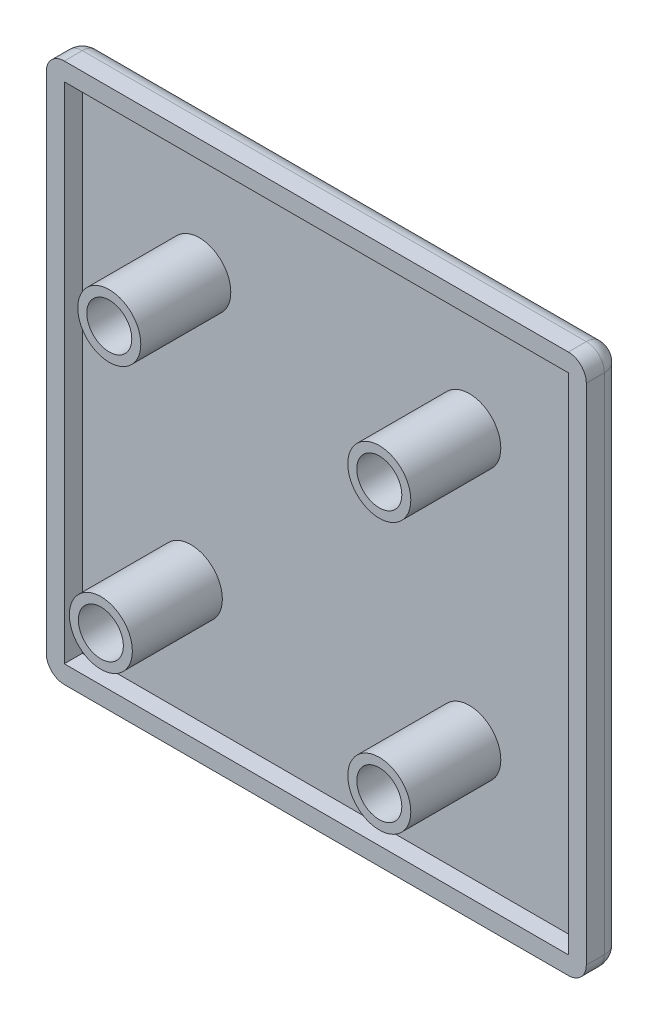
from build123d import *

# Parameters (mm, degrees)
SKETCH_1_W      = 60
SKETCH_1_H      = 60
EXTRUDE_1_DEPTH = 2
SHELL_1_T       = -2
FILLET_2_R      = 2
SKETCH_2_R      = 3.5
SKETCH_2_R_2    = 2.5
EXTRUDE_2_DEPTH = 10


with BuildPart() as part:
    # Sketch 1 → Extrude 1 (new, symmetric)
    with BuildSketch(Plane.XY):
        Rectangle(SKETCH_1_W, SKETCH_1_H)
    extrude(amount=EXTRUDE_1_DEPTH, both=True)

    # Shell 1
    shell_1_openings = [part.faces().sort_by_distance(p)[0] for p in [
        (0, 0, 2),
    ]]
    offset(amount=SHELL_1_T, openings=shell_1_openings, kind=Kind.INTERSECTION)

    # Fillet 2
    fillet_2_edges = [part.edges().sort_by_distance(p)[0] for p in [
        (0, 30, -2),
        (30, 0, -2),
        (0, -30, -2),
        (-30, 0, -2),
        (-30, 30, 0),
        (30, 30, 0),
        (30, -30, 0),
        (-30, -30, 0),
    ]]
    fillet(fillet_2_edges, radius=FILLET_2_R)

    # Sketch 2 → Extrude 2 (add)
    # profile 1 of 4: a face of its own
    with BuildSketch(Plane.XY):
        with Locations((-15, 15)):
            Circle(SKETCH_2_R)
        with Locations((-15, 15)):
            Circle(SKETCH_2_R_2, mode=Mode.SUBTRACT)
    # profile 2 of 4: a face of its own
    with BuildSketch(Plane.XY):
        with Locations((15, 15)):
            Circle(SKETCH_2_R)
        with Locations((15, 15)):
            Circle(SKETCH_2_R_2, mode=Mode.SUBTRACT)
    # profile 3 of 4: a face of its own
    with BuildSketch(Plane.XY):
        with Locations((15, -15)):
            Circle(SKETCH_2_R)
        with Locations((15, -15)):
            Circle(SKETCH_2_R_2, mode=Mode.SUBTRACT)
    # profile 4 of 4: a face of its own
    with BuildSketch(Plane.XY):
        with Locations((-15.938044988, -15)):
            Circle(SKETCH_2_R)
        with Locations((-15.938044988, -15)):
            Circle(SKETCH_2_R_2, mode=Mode.SUBTRACT)
    extrude(amount=EXTRUDE_2_DEPTH)


solid = part.part
